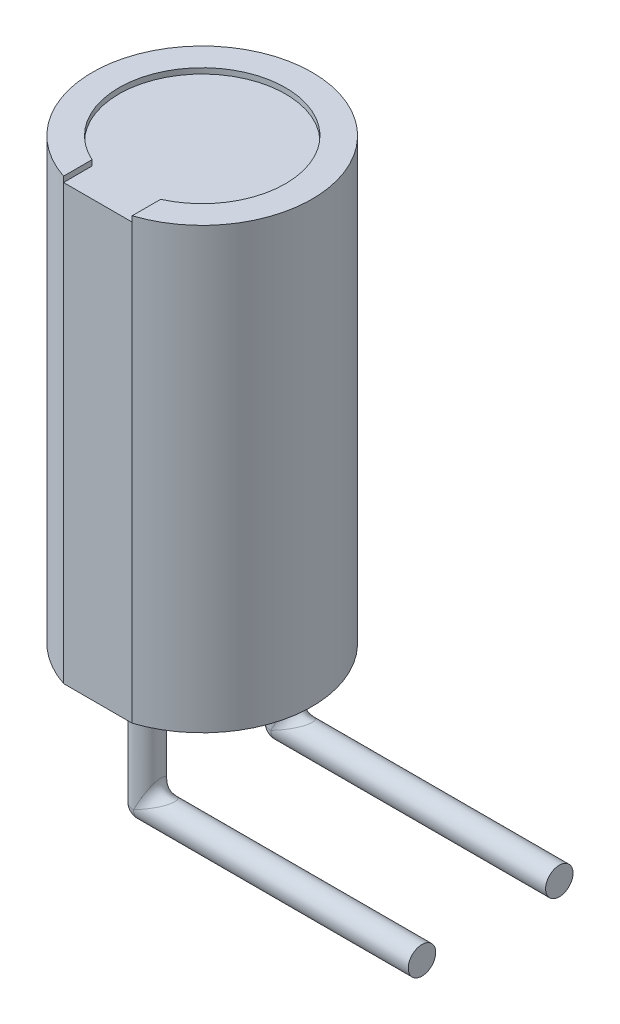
ISO-10303-21;
HEADER;
FILE_DESCRIPTION(('STEP AP214'),'2;1');
FILE_NAME('part.step','',(''),(''),'','','');
FILE_SCHEMA(('AUTOMOTIVE_DESIGN { 1 0 10303 214 1 1 1 1 }'));
ENDSEC;
DATA;
#1=APPLICATION_CONTEXT('core data for automotive mechanical design processes');
#2=APPLICATION_PROTOCOL_DEFINITION('international standard','automotive_design',2000,#1);
#3=PRODUCT_CONTEXT('',#1,'mechanical');
#4=PRODUCT('Part','Part','',(#3));
#5=PRODUCT_RELATED_PRODUCT_CATEGORY('part','',(#4));
#6=PRODUCT_DEFINITION_FORMATION('','',#4);
#7=PRODUCT_DEFINITION_CONTEXT('part definition',#1,'design');
#8=PRODUCT_DEFINITION('design','',#6,#7);
#9=PRODUCT_DEFINITION_SHAPE('','',#8);
#10=(LENGTH_UNIT() NAMED_UNIT(*) SI_UNIT(.MILLI.,.METRE.));
#11=(NAMED_UNIT(*) PLANE_ANGLE_UNIT() SI_UNIT($,.RADIAN.));
#12=(NAMED_UNIT(*) SI_UNIT($,.STERADIAN.) SOLID_ANGLE_UNIT());
#13=UNCERTAINTY_MEASURE_WITH_UNIT(LENGTH_MEASURE(1.E-05),#10,'distance_accuracy_value','');
#14=(GEOMETRIC_REPRESENTATION_CONTEXT(3) GLOBAL_UNCERTAINTY_ASSIGNED_CONTEXT((#13)) GLOBAL_UNIT_ASSIGNED_CONTEXT((#10,
#11,#12)) REPRESENTATION_CONTEXT('',''));
#15=CARTESIAN_POINT('',(0.,0.,0.));
#16=DIRECTION('',(0.,0.,1.));
#17=DIRECTION('',(1.,0.,0.));
#18=AXIS2_PLACEMENT_3D('',#15,#16,#17);
#19=CARTESIAN_POINT('',(0.,0.,0.));
#20=DIRECTION('',(0.,1.,0.));
#21=DIRECTION('',(0.,0.,1.));
#22=AXIS2_PLACEMENT_3D('',#19,#20,#21);
#23=PLANE('',#22);
#24=CARTESIAN_POINT('',(0.,0.,1.));
#25=DIRECTION('',(0.,-1.,0.));
#26=DIRECTION('',(0.,0.,-1.));
#27=AXIS2_PLACEMENT_3D('',#24,#25,#26);
#28=CIRCLE('',#27,0.25);
#29=CARTESIAN_POINT('',(0.,0.,0.75));
#30=VERTEX_POINT('',#29);
#31=EDGE_CURVE('E149',#30,#30,#28,.T.);
#32=ORIENTED_EDGE('',*,*,#31,.F.);
#33=EDGE_LOOP('',(#32));
#34=FACE_BOUND('',#33,.T.);
#35=CARTESIAN_POINT('',(0.,0.,0.));
#36=DIRECTION('',(0.,1.,0.));
#37=DIRECTION('',(0.,0.,1.));
#38=AXIS2_PLACEMENT_3D('',#35,#36,#37);
#39=CIRCLE('',#38,2.);
#40=CARTESIAN_POINT('',(0.624499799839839,0.,1.9));
#41=VERTEX_POINT('',#40);
#42=CARTESIAN_POINT('',(-0.62449979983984,0.,1.9));
#43=VERTEX_POINT('',#42);
#44=EDGE_CURVE('E142',#41,#43,#39,.T.);
#45=ORIENTED_EDGE('',*,*,#44,.F.);
#46=DIRECTION('',(-1.,0.,0.));
#47=VECTOR('',#46,1.);
#48=CARTESIAN_POINT('',(0.,0.,1.9));
#49=LINE('',#48,#47);
#50=EDGE_CURVE('E146',#41,#43,#49,.T.);
#51=ORIENTED_EDGE('',*,*,#50,.T.);
#52=EDGE_LOOP('',(#45,#51));
#53=FACE_BOUND('',#52,.T.);
#54=CARTESIAN_POINT('',(0.,0.,-1.5));
#55=DIRECTION('',(0.,-1.,0.));
#56=DIRECTION('',(0.,0.,-1.));
#57=AXIS2_PLACEMENT_3D('',#54,#55,#56);
#58=CIRCLE('',#57,0.25);
#59=CARTESIAN_POINT('',(0.,0.,-1.75));
#60=VERTEX_POINT('',#59);
#61=EDGE_CURVE('E154',#60,#60,#58,.T.);
#62=ORIENTED_EDGE('',*,*,#61,.F.);
#63=EDGE_LOOP('',(#62));
#64=FACE_BOUND('',#63,.T.);
#65=ADVANCED_FACE('F39',(#34,#53,#64),#23,.F.);
#66=CARTESIAN_POINT('',(-1.,8.,1.9));
#67=DIRECTION('',(0.,0.,-1.));
#68=DIRECTION('',(-1.,0.,0.));
#69=AXIS2_PLACEMENT_3D('',#66,#67,#68);
#70=PLANE('',#69);
#71=DIRECTION('',(1.,0.,0.));
#72=VECTOR('',#71,1.);
#73=CARTESIAN_POINT('',(-0.62449979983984,7.9,1.9));
#74=LINE('',#73,#72);
#75=CARTESIAN_POINT('',(-0.62449979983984,7.9,1.9));
#76=VERTEX_POINT('',#75);
#77=CARTESIAN_POINT('',(0.624499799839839,7.9,1.9));
#78=VERTEX_POINT('',#77);
#79=EDGE_CURVE('E129',#76,#78,#74,.T.);
#80=ORIENTED_EDGE('',*,*,#79,.F.);
#81=DIRECTION('',(0.,-1.,0.));
#82=VECTOR('',#81,1.);
#83=CARTESIAN_POINT('',(-0.62449979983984,8.,1.9));
#84=LINE('',#83,#82);
#85=EDGE_CURVE('E134',#43,#76,#84,.F.);
#86=ORIENTED_EDGE('',*,*,#85,.F.);
#87=ORIENTED_EDGE('',*,*,#50,.F.);
#88=DIRECTION('',(0.,-1.,0.));
#89=VECTOR('',#88,1.);
#90=CARTESIAN_POINT('',(0.62449979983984,8.,1.9));
#91=LINE('',#90,#89);
#92=EDGE_CURVE('E138',#78,#41,#91,.T.);
#93=ORIENTED_EDGE('',*,*,#92,.F.);
#94=EDGE_LOOP('',(#80,#86,#87,#93));
#95=FACE_BOUND('',#94,.T.);
#96=ADVANCED_FACE('F187',(#95),#70,.F.);
#97=CARTESIAN_POINT('',(0.,8.,0.));
#98=DIRECTION('',(0.,-1.,0.));
#99=DIRECTION('',(0.,0.,-1.));
#100=AXIS2_PLACEMENT_3D('',#97,#98,#99);
#101=CYLINDRICAL_SURFACE('',#100,2.);
#102=CARTESIAN_POINT('',(0.,8.,0.));
#103=DIRECTION('',(0.,1.,0.));
#104=DIRECTION('',(0.,0.,1.));
#105=AXIS2_PLACEMENT_3D('',#102,#103,#104);
#106=CIRCLE('',#105,2.);
#107=CARTESIAN_POINT('',(0.624499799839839,8.,1.9));
#108=VERTEX_POINT('',#107);
#109=CARTESIAN_POINT('',(-0.62449979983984,8.,1.9));
#110=VERTEX_POINT('',#109);
#111=EDGE_CURVE('E120',#108,#110,#106,.T.);
#112=ORIENTED_EDGE('',*,*,#111,.F.);
#113=EDGE_CURVE('E139',#108,#78,#91,.T.);
#114=ORIENTED_EDGE('',*,*,#113,.T.);
#115=ORIENTED_EDGE('',*,*,#92,.T.);
#116=ORIENTED_EDGE('',*,*,#44,.T.);
#117=ORIENTED_EDGE('',*,*,#85,.T.);
#118=DIRECTION('',(0.,1.,0.));
#119=VECTOR('',#118,1.);
#120=CARTESIAN_POINT('',(-0.62449979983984,7.9,1.9));
#121=LINE('',#120,#119);
#122=EDGE_CURVE('E105',#76,#110,#121,.T.);
#123=ORIENTED_EDGE('',*,*,#122,.T.);
#124=EDGE_LOOP('',(#112,#114,#115,#116,#117,#123));
#125=FACE_BOUND('',#124,.T.);
#126=ADVANCED_FACE('F41',(#125),#101,.T.);
#127=CARTESIAN_POINT('',(0.,8.,0.));
#128=DIRECTION('',(0.,1.,0.));
#129=DIRECTION('',(0.,0.,1.));
#130=AXIS2_PLACEMENT_3D('',#127,#128,#129);
#131=PLANE('',#130);
#132=DIRECTION('',(0.,0.,-1.));
#133=VECTOR('',#132,1.);
#134=CARTESIAN_POINT('',(0.624499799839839,8.,1.38143930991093));
#135=LINE('',#134,#133);
#136=CARTESIAN_POINT('',(0.624499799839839,8.,1.38143930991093));
#137=VERTEX_POINT('',#136);
#138=EDGE_CURVE('E121',#108,#137,#135,.T.);
#139=ORIENTED_EDGE('',*,*,#138,.F.);
#140=ORIENTED_EDGE('',*,*,#111,.T.);
#141=DIRECTION('',(0.,0.,1.));
#142=VECTOR('',#141,1.);
#143=CARTESIAN_POINT('',(-0.624499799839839,8.,1.38143930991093));
#144=LINE('',#143,#142);
#145=CARTESIAN_POINT('',(-0.624499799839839,8.,1.38143930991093));
#146=VERTEX_POINT('',#145);
#147=EDGE_CURVE('E99',#146,#110,#144,.T.);
#148=ORIENTED_EDGE('',*,*,#147,.F.);
#149=CARTESIAN_POINT('',(0.,8.,0.));
#150=DIRECTION('',(0.,1.,0.));
#151=DIRECTION('',(0.,0.,1.));
#152=AXIS2_PLACEMENT_3D('',#149,#150,#151);
#153=CIRCLE('',#152,1.51603910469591);
#154=EDGE_CURVE('E109',#137,#146,#153,.T.);
#155=ORIENTED_EDGE('',*,*,#154,.F.);
#156=EDGE_LOOP('',(#139,#140,#148,#155));
#157=FACE_BOUND('',#156,.T.);
#158=ADVANCED_FACE('F118',(#157),#131,.T.);
#159=CARTESIAN_POINT('',(0.,7.9,0.));
#160=DIRECTION('',(0.,1.,0.));
#161=DIRECTION('',(0.,0.,1.));
#162=AXIS2_PLACEMENT_3D('',#159,#160,#161);
#163=CYLINDRICAL_SURFACE('',#162,1.51603910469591);
#164=ORIENTED_EDGE('',*,*,#154,.T.);
#165=DIRECTION('',(0.,1.,0.));
#166=VECTOR('',#165,1.);
#167=CARTESIAN_POINT('',(-0.624499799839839,7.9,1.38143930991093));
#168=LINE('',#167,#166);
#169=CARTESIAN_POINT('',(-0.624499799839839,7.9,1.38143930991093));
#170=VERTEX_POINT('',#169);
#171=EDGE_CURVE('E94',#170,#146,#168,.T.);
#172=ORIENTED_EDGE('',*,*,#171,.F.);
#173=CARTESIAN_POINT('',(0.,7.9,0.));
#174=DIRECTION('',(0.,1.,0.));
#175=DIRECTION('',(0.,0.,1.));
#176=AXIS2_PLACEMENT_3D('',#173,#174,#175);
#177=CIRCLE('',#176,1.51603910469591);
#178=CARTESIAN_POINT('',(0.624499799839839,7.9,1.38143930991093));
#179=VERTEX_POINT('',#178);
#180=EDGE_CURVE('E123',#179,#170,#177,.T.);
#181=ORIENTED_EDGE('',*,*,#180,.F.);
#182=DIRECTION('',(0.,1.,0.));
#183=VECTOR('',#182,1.);
#184=CARTESIAN_POINT('',(0.624499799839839,7.9,1.38143930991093));
#185=LINE('',#184,#183);
#186=EDGE_CURVE('E111',#179,#137,#185,.T.);
#187=ORIENTED_EDGE('',*,*,#186,.T.);
#188=EDGE_LOOP('',(#164,#172,#181,#187));
#189=FACE_BOUND('',#188,.T.);
#190=ADVANCED_FACE('F110',(#189),#163,.F.);
#191=CARTESIAN_POINT('',(0.624499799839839,7.9,1.38143930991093));
#192=DIRECTION('',(1.,0.,0.));
#193=DIRECTION('',(0.,0.,-1.));
#194=AXIS2_PLACEMENT_3D('',#191,#192,#193);
#195=PLANE('',#194);
#196=ORIENTED_EDGE('',*,*,#138,.T.);
#197=ORIENTED_EDGE('',*,*,#186,.F.);
#198=DIRECTION('',(0.,0.,-1.));
#199=VECTOR('',#198,1.);
#200=CARTESIAN_POINT('',(0.624499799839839,7.9,1.38143930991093));
#201=LINE('',#200,#199);
#202=EDGE_CURVE('E106',#78,#179,#201,.T.);
#203=ORIENTED_EDGE('',*,*,#202,.F.);
#204=ORIENTED_EDGE('',*,*,#113,.F.);
#205=EDGE_LOOP('',(#196,#197,#203,#204));
#206=FACE_BOUND('',#205,.T.);
#207=ADVANCED_FACE('F203',(#206),#195,.F.);
#208=CARTESIAN_POINT('',(-0.624499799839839,7.9,1.38143930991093));
#209=DIRECTION('',(-1.,0.,0.));
#210=DIRECTION('',(0.,0.,1.));
#211=AXIS2_PLACEMENT_3D('',#208,#209,#210);
#212=PLANE('',#211);
#213=ORIENTED_EDGE('',*,*,#147,.T.);
#214=ORIENTED_EDGE('',*,*,#122,.F.);
#215=DIRECTION('',(0.,0.,1.));
#216=VECTOR('',#215,1.);
#217=CARTESIAN_POINT('',(-0.624499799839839,7.9,1.38143930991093));
#218=LINE('',#217,#216);
#219=EDGE_CURVE('E101',#170,#76,#218,.T.);
#220=ORIENTED_EDGE('',*,*,#219,.F.);
#221=ORIENTED_EDGE('',*,*,#171,.T.);
#222=EDGE_LOOP('',(#213,#214,#220,#221));
#223=FACE_BOUND('',#222,.T.);
#224=ADVANCED_FACE('F96',(#223),#212,.F.);
#225=CARTESIAN_POINT('',(0.,7.9,0.));
#226=DIRECTION('',(0.,1.,0.));
#227=DIRECTION('',(0.,0.,1.));
#228=AXIS2_PLACEMENT_3D('',#225,#226,#227);
#229=PLANE('',#228);
#230=ORIENTED_EDGE('',*,*,#180,.T.);
#231=ORIENTED_EDGE('',*,*,#219,.T.);
#232=ORIENTED_EDGE('',*,*,#79,.T.);
#233=ORIENTED_EDGE('',*,*,#202,.T.);
#234=EDGE_LOOP('',(#230,#231,#232,#233));
#235=FACE_BOUND('',#234,.T.);
#236=ADVANCED_FACE('F212',(#235),#229,.T.);
#237=CARTESIAN_POINT('',(0.,-2.,1.));
#238=DIRECTION('',(1.,0.,0.));
#239=DIRECTION('',(0.,0.,-1.));
#240=AXIS2_PLACEMENT_3D('',#237,#238,#239);
#241=CYLINDRICAL_SURFACE('',#240,0.25);
#242=CARTESIAN_POINT('',(0.,-2.,1.));
#243=DIRECTION('',(-0.447213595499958,0.894427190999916,0.));
#244=DIRECTION('',(0.894427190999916,0.447213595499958,0.));
#245=AXIS2_PLACEMENT_3D('',#242,#243,#244);
#246=ELLIPSE('',#245,0.559016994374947,0.25);
#247=CARTESIAN_POINT('',(0.,-2.,0.75));
#248=VERTEX_POINT('',#247);
#249=CARTESIAN_POINT('',(0.,-2.,1.25));
#250=VERTEX_POINT('',#249);
#251=EDGE_CURVE('E150',#248,#250,#246,.F.);
#252=ORIENTED_EDGE('',*,*,#251,.T.);
#253=CARTESIAN_POINT('',(0.,-2.,1.));
#254=DIRECTION('',(1.,0.,0.));
#255=DIRECTION('',(0.,0.,-1.));
#256=AXIS2_PLACEMENT_3D('',#253,#254,#255);
#257=CIRCLE('',#256,0.25);
#258=EDGE_CURVE('E153',#250,#248,#257,.T.);
#259=ORIENTED_EDGE('',*,*,#258,.T.);
#260=EDGE_LOOP('',(#252,#259));
#261=FACE_BOUND('',#260,.T.);
#262=CARTESIAN_POINT('',(5.,-2.,1.));
#263=DIRECTION('',(1.,0.,0.));
#264=DIRECTION('',(0.,0.,-1.));
#265=AXIS2_PLACEMENT_3D('',#262,#263,#264);
#266=CIRCLE('',#265,0.25);
#267=CARTESIAN_POINT('',(5.,-2.,0.75));
#268=VERTEX_POINT('',#267);
#269=EDGE_CURVE('E115',#268,#268,#266,.F.);
#270=ORIENTED_EDGE('',*,*,#269,.T.);
#271=EDGE_LOOP('',(#270));
#272=FACE_BOUND('',#271,.T.);
#273=ADVANCED_FACE('F223',(#261,#272),#241,.T.);
#274=CARTESIAN_POINT('',(0.,-2.70710678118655,1.));
#275=DIRECTION('',(0.,1.,0.));
#276=DIRECTION('',(-1.,0.,0.));
#277=AXIS2_PLACEMENT_3D('',#274,#275,#276);
#278=CYLINDRICAL_SURFACE('',#277,0.25);
#279=ORIENTED_EDGE('',*,*,#31,.T.);
#280=EDGE_LOOP('',(#279));
#281=FACE_BOUND('',#280,.T.);
#282=CARTESIAN_POINT('',(0.,-2.,1.));
#283=DIRECTION('',(0.,1.,0.));
#284=DIRECTION('',(-1.,0.,0.));
#285=AXIS2_PLACEMENT_3D('',#282,#283,#284);
#286=CIRCLE('',#285,0.25);
#287=EDGE_CURVE('E157',#248,#250,#286,.T.);
#288=ORIENTED_EDGE('',*,*,#287,.T.);
#289=CARTESIAN_POINT('',(0.,-2.,1.));
#290=DIRECTION('',(-0.894427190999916,0.447213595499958,0.));
#291=DIRECTION('',(0.447213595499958,0.894427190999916,0.));
#292=AXIS2_PLACEMENT_3D('',#289,#290,#291);
#293=ELLIPSE('',#292,0.559016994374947,0.25);
#294=EDGE_CURVE('E160',#250,#248,#293,.T.);
#295=ORIENTED_EDGE('',*,*,#294,.T.);
#296=EDGE_LOOP('',(#288,#295));
#297=FACE_BOUND('',#296,.T.);
#298=ADVANCED_FACE('F227',(#281,#297),#278,.T.);
#299=CARTESIAN_POINT('',(5.,-2.,1.));
#300=DIRECTION('',(1.,0.,0.));
#301=DIRECTION('',(0.,0.,-1.));
#302=AXIS2_PLACEMENT_3D('',#299,#300,#301);
#303=PLANE('',#302);
#304=ORIENTED_EDGE('',*,*,#269,.F.);
#305=EDGE_LOOP('',(#304));
#306=FACE_BOUND('',#305,.T.);
#307=ADVANCED_FACE('F250',(#306),#303,.T.);
#308=CARTESIAN_POINT('',(0.,-2.,-1.5));
#309=DIRECTION('',(1.,0.,0.));
#310=DIRECTION('',(0.,0.,-1.));
#311=AXIS2_PLACEMENT_3D('',#308,#309,#310);
#312=CYLINDRICAL_SURFACE('',#311,0.25);
#313=CARTESIAN_POINT('',(0.,-2.,-1.5));
#314=DIRECTION('',(-0.447213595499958,0.894427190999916,0.));
#315=DIRECTION('',(0.894427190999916,0.447213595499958,0.));
#316=AXIS2_PLACEMENT_3D('',#313,#314,#315);
#317=ELLIPSE('',#316,0.559016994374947,0.25);
#318=CARTESIAN_POINT('',(0.,-2.,-1.75));
#319=VERTEX_POINT('',#318);
#320=CARTESIAN_POINT('',(0.,-2.,-1.25));
#321=VERTEX_POINT('',#320);
#322=EDGE_CURVE('E163',#319,#321,#317,.F.);
#323=ORIENTED_EDGE('',*,*,#322,.T.);
#324=CARTESIAN_POINT('',(0.,-2.,-1.5));
#325=DIRECTION('',(1.,0.,0.));
#326=DIRECTION('',(0.,0.,-1.));
#327=AXIS2_PLACEMENT_3D('',#324,#325,#326);
#328=CIRCLE('',#327,0.25);
#329=EDGE_CURVE('E166',#321,#319,#328,.T.);
#330=ORIENTED_EDGE('',*,*,#329,.T.);
#331=EDGE_LOOP('',(#323,#330));
#332=FACE_BOUND('',#331,.T.);
#333=CARTESIAN_POINT('',(5.,-2.,-1.5));
#334=DIRECTION('',(1.,0.,0.));
#335=DIRECTION('',(0.,0.,-1.));
#336=AXIS2_PLACEMENT_3D('',#333,#334,#335);
#337=CIRCLE('',#336,0.25);
#338=CARTESIAN_POINT('',(5.,-2.,-1.75));
#339=VERTEX_POINT('',#338);
#340=EDGE_CURVE('E242',#339,#339,#337,.F.);
#341=ORIENTED_EDGE('',*,*,#340,.T.);
#342=EDGE_LOOP('',(#341));
#343=FACE_BOUND('',#342,.T.);
#344=ADVANCED_FACE('F171',(#332,#343),#312,.T.);
#345=CARTESIAN_POINT('',(0.,-2.70710678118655,-1.5));
#346=DIRECTION('',(0.,1.,0.));
#347=DIRECTION('',(-1.,0.,0.));
#348=AXIS2_PLACEMENT_3D('',#345,#346,#347);
#349=CYLINDRICAL_SURFACE('',#348,0.25);
#350=ORIENTED_EDGE('',*,*,#61,.T.);
#351=EDGE_LOOP('',(#350));
#352=FACE_BOUND('',#351,.T.);
#353=CARTESIAN_POINT('',(0.,-2.,-1.5));
#354=DIRECTION('',(0.,1.,0.));
#355=DIRECTION('',(-1.,0.,0.));
#356=AXIS2_PLACEMENT_3D('',#353,#354,#355);
#357=CIRCLE('',#356,0.25);
#358=EDGE_CURVE('E47',#319,#321,#357,.T.);
#359=ORIENTED_EDGE('',*,*,#358,.T.);
#360=CARTESIAN_POINT('',(0.,-2.,-1.5));
#361=DIRECTION('',(-0.894427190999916,0.447213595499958,0.));
#362=DIRECTION('',(0.447213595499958,0.894427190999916,0.));
#363=AXIS2_PLACEMENT_3D('',#360,#361,#362);
#364=ELLIPSE('',#363,0.559016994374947,0.25);
#365=EDGE_CURVE('E12',#321,#319,#364,.T.);
#366=ORIENTED_EDGE('',*,*,#365,.T.);
#367=EDGE_LOOP('',(#359,#366));
#368=FACE_BOUND('',#367,.T.);
#369=ADVANCED_FACE('F169',(#352,#368),#349,.T.);
#370=CARTESIAN_POINT('',(5.,-2.,-1.5));
#371=DIRECTION('',(1.,0.,0.));
#372=DIRECTION('',(0.,0.,-1.));
#373=AXIS2_PLACEMENT_3D('',#370,#371,#372);
#374=PLANE('',#373);
#375=ORIENTED_EDGE('',*,*,#340,.F.);
#376=EDGE_LOOP('',(#375));
#377=FACE_BOUND('',#376,.T.);
#378=ADVANCED_FACE('F264',(#377),#374,.T.);
#379=CARTESIAN_POINT('',(0.,-2.,1.));
#380=DIRECTION('',(0.,0.,1.));
#381=DIRECTION('',(1.,0.,0.));
#382=AXIS2_PLACEMENT_3D('',#379,#380,#381);
#383=SPHERICAL_SURFACE('',#382,0.25);
#384=ORIENTED_EDGE('',*,*,#258,.F.);
#385=ORIENTED_EDGE('',*,*,#287,.F.);
#386=EDGE_LOOP('',(#384,#385));
#387=FACE_BOUND('',#386,.T.);
#388=ADVANCED_FACE('F183',(#387),#383,.T.);
#389=CARTESIAN_POINT('',(0.,-2.,0.75));
#390=CARTESIAN_POINT('',(0.,-2.,0.75));
#391=CARTESIAN_POINT('',(0.,-2.,0.75));
#392=CARTESIAN_POINT('',(0.021782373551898,-1.98910881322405,0.750004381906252));
#393=CARTESIAN_POINT('',(0.0163401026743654,-1.98365989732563,0.749968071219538));
#394=CARTESIAN_POINT('',(0.0108911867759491,-1.9782176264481,0.750004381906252));
#395=CARTESIAN_POINT('',(0.0435703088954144,-1.97821484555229,0.750712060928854));
#396=CARTESIAN_POINT('',(0.0327250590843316,-1.96727494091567,0.751424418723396));
#397=CARTESIAN_POINT('',(0.0217851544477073,-1.95642969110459,0.750712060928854));
#398=CARTESIAN_POINT('',(0.0867714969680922,-1.95661425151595,0.753553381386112));
#399=CARTESIAN_POINT('',(0.06484351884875,-1.93515648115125,0.757104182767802));
#400=CARTESIAN_POINT('',(0.0433857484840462,-1.91322850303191,0.753553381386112));
#401=CARTESIAN_POINT('',(0.108186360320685,-1.94590681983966,0.755674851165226));
#402=CARTESIAN_POINT('',(0.0806697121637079,-1.91933028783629,0.761335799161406));
#403=CARTESIAN_POINT('',(0.0540931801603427,-1.89181363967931,0.755674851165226));
#404=CARTESIAN_POINT('',(0.150276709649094,-1.92486164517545,0.761314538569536));
#405=CARTESIAN_POINT('',(0.111116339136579,-1.88888366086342,0.772406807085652));
#406=CARTESIAN_POINT('',(0.0751383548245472,-1.84972329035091,0.761314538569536));
#407=CARTESIAN_POINT('',(0.170958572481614,-1.91452071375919,0.764808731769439));
#408=CARTESIAN_POINT('',(0.125828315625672,-1.87417168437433,0.77926236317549));
#409=CARTESIAN_POINT('',(0.085479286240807,-1.82904142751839,0.764808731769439));
#410=CARTESIAN_POINT('',(0.211222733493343,-1.89438863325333,0.773147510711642));
#411=CARTESIAN_POINT('',(0.153510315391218,-1.84648968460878,0.795228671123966));
#412=CARTESIAN_POINT('',(0.105611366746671,-1.78877726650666,0.773147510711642));
#413=CARTESIAN_POINT('',(0.230819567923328,-1.88459021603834,0.777956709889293));
#414=CARTESIAN_POINT('',(0.166568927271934,-1.83343107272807,0.804363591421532));
#415=CARTESIAN_POINT('',(0.115409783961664,-1.76918043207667,0.777956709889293));
#416=CARTESIAN_POINT('',(0.268569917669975,-1.86571504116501,0.788854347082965));
#417=CARTESIAN_POINT('',(0.190445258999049,-1.80955474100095,0.824374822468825));
#418=CARTESIAN_POINT('',(0.134284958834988,-1.73143008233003,0.788854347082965));
#419=CARTESIAN_POINT('',(0.286749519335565,-1.85662524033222,0.794897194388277));
#420=CARTESIAN_POINT('',(0.201346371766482,-1.79865362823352,0.835282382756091));
#421=CARTESIAN_POINT('',(0.143374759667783,-1.71325048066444,0.794897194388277));
#422=CARTESIAN_POINT('',(0.321342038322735,-1.83932898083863,0.808169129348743));
#423=CARTESIAN_POINT('',(0.220487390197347,-1.77951260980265,0.858113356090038));
#424=CARTESIAN_POINT('',(0.160671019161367,-1.67865796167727,0.808169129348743));
#425=CARTESIAN_POINT('',(0.337795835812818,-1.83110208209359,0.815344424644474));
#426=CARTESIAN_POINT('',(0.228802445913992,-1.77119755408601,0.87007302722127));
#427=CARTESIAN_POINT('',(0.168897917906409,-1.66220416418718,0.815344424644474));
#428=CARTESIAN_POINT('',(0.368639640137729,-1.81568017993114,0.830766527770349));
#429=CARTESIAN_POINT('',(0.242503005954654,-1.75749699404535,0.894051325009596));
#430=CARTESIAN_POINT('',(0.184319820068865,-1.63136035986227,0.830766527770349));
#431=CARTESIAN_POINT('',(0.383087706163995,-1.808456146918,0.838954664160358));
#432=CARTESIAN_POINT('',(0.247952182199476,-1.75204781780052,0.906107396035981));
#433=CARTESIAN_POINT('',(0.191543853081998,-1.616912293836,0.838954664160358));
#434=CARTESIAN_POINT('',(0.409654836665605,-1.7951725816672,0.856266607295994));
#435=CARTESIAN_POINT('',(0.255920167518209,-1.74407983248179,0.929115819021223));
#436=CARTESIAN_POINT('',(0.204827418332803,-1.59034516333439,0.856266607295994));
#437=CARTESIAN_POINT('',(0.421849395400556,-1.78907530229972,0.865331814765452));
#438=CARTESIAN_POINT('',(0.258488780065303,-1.7415112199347,0.940101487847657));
#439=CARTESIAN_POINT('',(0.210924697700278,-1.57815060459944,0.865331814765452));
#440=CARTESIAN_POINT('',(0.443682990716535,-1.77815850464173,0.88424119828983));
#441=CARTESIAN_POINT('',(0.261106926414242,-1.73889307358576,0.959751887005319));
#442=CARTESIAN_POINT('',(0.221841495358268,-1.55631700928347,0.88424119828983));
#443=CARTESIAN_POINT('',(0.453411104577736,-1.77329444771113,0.894033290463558));
#444=CARTESIAN_POINT('',(0.261192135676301,-1.7388078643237,0.968440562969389));
#445=CARTESIAN_POINT('',(0.226705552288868,-1.54658889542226,0.894033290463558));
#446=CARTESIAN_POINT('',(0.470132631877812,-1.76493368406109,0.914219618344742));
#447=CARTESIAN_POINT('',(0.259765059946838,-1.74023494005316,0.982582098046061));
#448=CARTESIAN_POINT('',(0.235066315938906,-1.52986736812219,0.914219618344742));
#449=CARTESIAN_POINT('',(0.477218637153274,-1.76139068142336,0.924574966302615));
#450=CARTESIAN_POINT('',(0.258276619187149,-1.74172338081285,0.988047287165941));
#451=CARTESIAN_POINT('',(0.238609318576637,-1.52278136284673,0.924574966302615));
#452=CARTESIAN_POINT('',(0.488534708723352,-1.75573264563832,0.945693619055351));
#453=CARTESIAN_POINT('',(0.255023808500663,-1.74497619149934,0.99566549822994));
#454=CARTESIAN_POINT('',(0.244267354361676,-1.51146529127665,0.945693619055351));
#455=CARTESIAN_POINT('',(0.492844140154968,-1.75357792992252,0.956435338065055));
#456=CARTESIAN_POINT('',(0.253274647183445,-1.74672535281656,0.997822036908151));
#457=CARTESIAN_POINT('',(0.246422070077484,-1.50715585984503,0.956435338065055));
#458=CARTESIAN_POINT('',(0.498553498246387,-1.75072325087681,0.978122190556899));
#459=CARTESIAN_POINT('',(0.250758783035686,-1.74924121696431,0.999985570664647));
#460=CARTESIAN_POINT('',(0.249276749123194,-1.50144650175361,0.978122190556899));
#461=CARTESIAN_POINT('',(0.5,-1.75,0.98906109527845));
#462=CARTESIAN_POINT('',(0.25,-1.75,0.999992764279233));
#463=CARTESIAN_POINT('',(0.25,-1.5,0.98906109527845));
#464=CARTESIAN_POINT('',(0.5,-1.75,1.01093890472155));
#465=CARTESIAN_POINT('',(0.25,-1.75,1.00000723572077));
#466=CARTESIAN_POINT('',(0.25,-1.5,1.01093890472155));
#467=CARTESIAN_POINT('',(0.498553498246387,-1.75072325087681,1.0218778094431));
#468=CARTESIAN_POINT('',(0.250758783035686,-1.74924121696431,1.00001442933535));
#469=CARTESIAN_POINT('',(0.249276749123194,-1.50144650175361,1.0218778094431));
#470=CARTESIAN_POINT('',(0.492844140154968,-1.75357792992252,1.04356466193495));
#471=CARTESIAN_POINT('',(0.253274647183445,-1.74672535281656,1.00217796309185));
#472=CARTESIAN_POINT('',(0.246422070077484,-1.50715585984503,1.04356466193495));
#473=CARTESIAN_POINT('',(0.488534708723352,-1.75573264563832,1.05430638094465));
#474=CARTESIAN_POINT('',(0.255023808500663,-1.74497619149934,1.00433450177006));
#475=CARTESIAN_POINT('',(0.244267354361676,-1.51146529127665,1.05430638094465));
#476=CARTESIAN_POINT('',(0.477218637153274,-1.76139068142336,1.07542503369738));
#477=CARTESIAN_POINT('',(0.258276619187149,-1.74172338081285,1.01195271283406));
#478=CARTESIAN_POINT('',(0.238609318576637,-1.52278136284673,1.07542503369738));
#479=CARTESIAN_POINT('',(0.470132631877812,-1.76493368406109,1.08578038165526));
#480=CARTESIAN_POINT('',(0.259765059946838,-1.74023494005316,1.01741790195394));
#481=CARTESIAN_POINT('',(0.235066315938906,-1.52986736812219,1.08578038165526));
#482=CARTESIAN_POINT('',(0.453411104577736,-1.77329444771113,1.10596670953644));
#483=CARTESIAN_POINT('',(0.261192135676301,-1.7388078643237,1.03155943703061));
#484=CARTESIAN_POINT('',(0.226705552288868,-1.54658889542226,1.10596670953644));
#485=CARTESIAN_POINT('',(0.443682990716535,-1.77815850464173,1.11575880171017));
#486=CARTESIAN_POINT('',(0.261106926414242,-1.73889307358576,1.04024811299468));
#487=CARTESIAN_POINT('',(0.221841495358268,-1.55631700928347,1.11575880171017));
#488=CARTESIAN_POINT('',(0.421849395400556,-1.78907530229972,1.13466818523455));
#489=CARTESIAN_POINT('',(0.258488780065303,-1.7415112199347,1.05989851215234));
#490=CARTESIAN_POINT('',(0.210924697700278,-1.57815060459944,1.13466818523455));
#491=CARTESIAN_POINT('',(0.409654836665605,-1.7951725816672,1.14373339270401));
#492=CARTESIAN_POINT('',(0.255920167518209,-1.74407983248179,1.07088418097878));
#493=CARTESIAN_POINT('',(0.204827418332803,-1.59034516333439,1.14373339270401));
#494=CARTESIAN_POINT('',(0.383087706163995,-1.808456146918,1.16104533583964));
#495=CARTESIAN_POINT('',(0.247952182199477,-1.75204781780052,1.09389260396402));
#496=CARTESIAN_POINT('',(0.191543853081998,-1.616912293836,1.16104533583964));
#497=CARTESIAN_POINT('',(0.368639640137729,-1.81568017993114,1.16923347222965));
#498=CARTESIAN_POINT('',(0.242503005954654,-1.75749699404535,1.1059486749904));
#499=CARTESIAN_POINT('',(0.184319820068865,-1.63136035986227,1.16923347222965));
#500=CARTESIAN_POINT('',(0.337795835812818,-1.83110208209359,1.18465557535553));
#501=CARTESIAN_POINT('',(0.228802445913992,-1.77119755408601,1.12992697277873));
#502=CARTESIAN_POINT('',(0.168897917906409,-1.66220416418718,1.18465557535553));
#503=CARTESIAN_POINT('',(0.321342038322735,-1.83932898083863,1.19183087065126));
#504=CARTESIAN_POINT('',(0.220487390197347,-1.77951260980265,1.14188664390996));
#505=CARTESIAN_POINT('',(0.160671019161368,-1.67865796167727,1.19183087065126));
#506=CARTESIAN_POINT('',(0.286749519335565,-1.85662524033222,1.20510280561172));
#507=CARTESIAN_POINT('',(0.201346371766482,-1.79865362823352,1.16471761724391));
#508=CARTESIAN_POINT('',(0.143374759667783,-1.71325048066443,1.20510280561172));
#509=CARTESIAN_POINT('',(0.268569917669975,-1.86571504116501,1.21114565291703));
#510=CARTESIAN_POINT('',(0.190445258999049,-1.80955474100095,1.17562517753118));
#511=CARTESIAN_POINT('',(0.134284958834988,-1.73143008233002,1.21114565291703));
#512=CARTESIAN_POINT('',(0.230819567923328,-1.88459021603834,1.22204329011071));
#513=CARTESIAN_POINT('',(0.166568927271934,-1.83343107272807,1.19563640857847));
#514=CARTESIAN_POINT('',(0.115409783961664,-1.76918043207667,1.22204329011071));
#515=CARTESIAN_POINT('',(0.211222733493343,-1.89438863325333,1.22685248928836));
#516=CARTESIAN_POINT('',(0.153510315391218,-1.84648968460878,1.20477132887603));
#517=CARTESIAN_POINT('',(0.105611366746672,-1.78877726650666,1.22685248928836));
#518=CARTESIAN_POINT('',(0.170958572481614,-1.91452071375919,1.23519126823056));
#519=CARTESIAN_POINT('',(0.125828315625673,-1.87417168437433,1.22073763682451));
#520=CARTESIAN_POINT('',(0.0854792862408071,-1.82904142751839,1.23519126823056));
#521=CARTESIAN_POINT('',(0.150276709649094,-1.92486164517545,1.23868546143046));
#522=CARTESIAN_POINT('',(0.111116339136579,-1.88888366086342,1.22759319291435));
#523=CARTESIAN_POINT('',(0.0751383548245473,-1.84972329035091,1.23868546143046));
#524=CARTESIAN_POINT('',(0.108186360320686,-1.94590681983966,1.24432514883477));
#525=CARTESIAN_POINT('',(0.0806697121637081,-1.91933028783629,1.23866420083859));
#526=CARTESIAN_POINT('',(0.0540931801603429,-1.89181363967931,1.24432514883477));
#527=CARTESIAN_POINT('',(0.0867714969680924,-1.95661425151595,1.24644661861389));
#528=CARTESIAN_POINT('',(0.0648435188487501,-1.93515648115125,1.2428958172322));
#529=CARTESIAN_POINT('',(0.0433857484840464,-1.91322850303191,1.24644661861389));
#530=CARTESIAN_POINT('',(0.0435703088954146,-1.97821484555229,1.24928793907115));
#531=CARTESIAN_POINT('',(0.0327250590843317,-1.96727494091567,1.2485755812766));
#532=CARTESIAN_POINT('',(0.0217851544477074,-1.95642969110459,1.24928793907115));
#533=CARTESIAN_POINT('',(0.0217823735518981,-1.98910881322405,1.24999561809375));
#534=CARTESIAN_POINT('',(0.0163401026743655,-1.98365989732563,1.25003192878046));
#535=CARTESIAN_POINT('',(0.0108911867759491,-1.9782176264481,1.24999561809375));
#536=CARTESIAN_POINT('',(0.,-2.,1.25));
#537=CARTESIAN_POINT('',(0.,-2.,1.25));
#538=CARTESIAN_POINT('',(0.,-2.,1.25));
#539=(BOUNDED_SURFACE() B_SPLINE_SURFACE(3,2,((#389,#390,#391),(#392,#393,#394),(#395,#396,
#397),(#398,#399,#400),(#401,#402,#403),(#404,#405,#406),(#407,#408,#409),(#410,#411,#412),
(#413,#414,#415),(#416,#417,#418),(#419,#420,#421),(#422,#423,#424),(#425,#426,#427),(#428,#429,
#430),(#431,#432,#433),(#434,#435,#436),(#437,#438,#439),(#440,#441,#442),(#443,#444,#445),
(#446,#447,#448),(#449,#450,#451),(#452,#453,#454),(#455,#456,#457),(#458,#459,#460),(#461,#462,
#463),(#464,#465,#466),(#467,#468,#469),(#470,#471,#472),(#473,#474,#475),(#476,#477,#478),
(#479,#480,#481),(#482,#483,#484),(#485,#486,#487),(#488,#489,#490),(#491,#492,#493),(#494,#495,
#496),(#497,#498,#499),(#500,#501,#502),(#503,#504,#505),(#506,#507,#508),(#509,#510,#511),
(#512,#513,#514),(#515,#516,#517),(#518,#519,#520),(#521,#522,#523),(#524,#525,#526),(#527,#528,
#529),(#530,#531,#532),(#533,#534,#535),(#536,#537,#538)),.UNSPECIFIED.,.F.,.F.,
.F.) B_SPLINE_SURFACE_WITH_KNOTS((4,2,2,2,2,2,2,2,2,2,2,2,2,2,2,2,2,2,2,2,2,2,2,2,4),(3,3),(0.,
0.0923950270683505,0.184004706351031,0.274077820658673,0.361932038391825,0.446989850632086,
0.528816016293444,0.607156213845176,0.681975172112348,0.753489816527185,0.822188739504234,
0.888824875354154,0.954367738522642,1.01991060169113,1.08654673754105,1.1552456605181,
1.22676030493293,1.30157926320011,1.37991946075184,1.4617456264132,1.54680343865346,
1.63465765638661,1.72473077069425,1.81634044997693,1.90873547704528),(0.,1.),
.UNSPECIFIED.) GEOMETRIC_REPRESENTATION_ITEM() RATIONAL_B_SPLINE_SURFACE(((1.,1.,1.),(1.,
1.00000566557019,1.),(1.,0.998576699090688,1.),(1.,0.992910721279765,1.),(1.,0.988697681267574,
1.),(1.,0.97761712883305,1.),(1.,0.970795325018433,1.),(1.,0.954789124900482,1.),(1.,
0.945667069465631,1.),(1.,0.92548796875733,1.),(1.,0.914501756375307,1.),(1.,0.891169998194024,
1.),(1.,0.878891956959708,1.),(1.,0.853706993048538,1.),(1.,0.84084914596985,1.),(1.,
0.815387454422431,1.),(1.,0.802798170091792,1.),(1.,0.778880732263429,1.),(1.,0.767521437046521,
1.),(1.,0.747118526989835,1.),(1.,0.738001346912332,1.),(1.,0.723039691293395,1.),(1.,
0.717105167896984,1.),(1.,0.709170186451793,1.),(1.,0.707106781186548,1.),(1.,0.707106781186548,
1.),(1.,0.709170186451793,1.),(1.,0.717105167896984,1.),(1.,0.723039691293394,1.),(1.,
0.738001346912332,1.),(1.,0.747118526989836,1.),(1.,0.767521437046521,1.),(1.,0.778880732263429,
1.),(1.,0.802798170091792,1.),(1.,0.815387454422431,1.),(1.,0.84084914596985,1.),(1.,
0.853706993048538,1.),(1.,0.878891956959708,1.),(1.,0.891169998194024,1.),(1.,0.914501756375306,
1.),(1.,0.92548796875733,1.),(1.,0.945667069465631,1.),(1.,0.954789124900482,1.),(1.,
0.970795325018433,1.),(1.,0.97761712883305,1.),(1.,0.988697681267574,1.),(1.,0.992910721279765,
1.),(1.,0.998576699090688,1.),(1.,1.00000566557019,1.),(1.,1.,1.))) REPRESENTATION_ITEM('') SURFACE());
#540=ORIENTED_EDGE('',*,*,#251,.F.);
#541=ORIENTED_EDGE('',*,*,#294,.F.);
#542=EDGE_LOOP('',(#540,#541));
#543=FACE_BOUND('',#542,.T.);
#544=ADVANCED_FACE('F176',(#543),#539,.F.);
#545=CARTESIAN_POINT('',(0.,-2.,-1.5));
#546=DIRECTION('',(0.,0.,1.));
#547=DIRECTION('',(1.,0.,0.));
#548=AXIS2_PLACEMENT_3D('',#545,#546,#547);
#549=SPHERICAL_SURFACE('',#548,0.25);
#550=ORIENTED_EDGE('',*,*,#329,.F.);
#551=ORIENTED_EDGE('',*,*,#358,.F.);
#552=EDGE_LOOP('',(#550,#551));
#553=FACE_BOUND('',#552,.T.);
#554=ADVANCED_FACE('F173',(#553),#549,.T.);
#555=CARTESIAN_POINT('',(0.,-2.,-1.75));
#556=CARTESIAN_POINT('',(0.,-2.,-1.75));
#557=CARTESIAN_POINT('',(0.,-2.,-1.75));
#558=CARTESIAN_POINT('',(0.021782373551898,-1.98910881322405,-1.74999561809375));
#559=CARTESIAN_POINT('',(0.0163401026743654,-1.98365989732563,-1.75003192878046));
#560=CARTESIAN_POINT('',(0.0108911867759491,-1.9782176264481,-1.74999561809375));
#561=CARTESIAN_POINT('',(0.0435703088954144,-1.97821484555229,-1.74928793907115));
#562=CARTESIAN_POINT('',(0.0327250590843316,-1.96727494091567,-1.7485755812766));
#563=CARTESIAN_POINT('',(0.0217851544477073,-1.95642969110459,-1.74928793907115));
#564=CARTESIAN_POINT('',(0.0867714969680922,-1.95661425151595,-1.74644661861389));
#565=CARTESIAN_POINT('',(0.06484351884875,-1.93515648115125,-1.7428958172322));
#566=CARTESIAN_POINT('',(0.0433857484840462,-1.91322850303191,-1.74644661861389));
#567=CARTESIAN_POINT('',(0.108186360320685,-1.94590681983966,-1.74432514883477));
#568=CARTESIAN_POINT('',(0.0806697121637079,-1.91933028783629,-1.73866420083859));
#569=CARTESIAN_POINT('',(0.0540931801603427,-1.89181363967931,-1.74432514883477));
#570=CARTESIAN_POINT('',(0.150276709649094,-1.92486164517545,-1.73868546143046));
#571=CARTESIAN_POINT('',(0.111116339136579,-1.88888366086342,-1.72759319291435));
#572=CARTESIAN_POINT('',(0.0751383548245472,-1.84972329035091,-1.73868546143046));
#573=CARTESIAN_POINT('',(0.170958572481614,-1.91452071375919,-1.73519126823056));
#574=CARTESIAN_POINT('',(0.125828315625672,-1.87417168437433,-1.72073763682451));
#575=CARTESIAN_POINT('',(0.085479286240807,-1.82904142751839,-1.73519126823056));
#576=CARTESIAN_POINT('',(0.211222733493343,-1.89438863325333,-1.72685248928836));
#577=CARTESIAN_POINT('',(0.153510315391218,-1.84648968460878,-1.70477132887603));
#578=CARTESIAN_POINT('',(0.105611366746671,-1.78877726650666,-1.72685248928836));
#579=CARTESIAN_POINT('',(0.230819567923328,-1.88459021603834,-1.72204329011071));
#580=CARTESIAN_POINT('',(0.166568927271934,-1.83343107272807,-1.69563640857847));
#581=CARTESIAN_POINT('',(0.115409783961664,-1.76918043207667,-1.72204329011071));
#582=CARTESIAN_POINT('',(0.268569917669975,-1.86571504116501,-1.71114565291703));
#583=CARTESIAN_POINT('',(0.190445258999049,-1.80955474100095,-1.67562517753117));
#584=CARTESIAN_POINT('',(0.134284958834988,-1.73143008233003,-1.71114565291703));
#585=CARTESIAN_POINT('',(0.286749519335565,-1.85662524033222,-1.70510280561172));
#586=CARTESIAN_POINT('',(0.201346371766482,-1.79865362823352,-1.66471761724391));
#587=CARTESIAN_POINT('',(0.143374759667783,-1.71325048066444,-1.70510280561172));
#588=CARTESIAN_POINT('',(0.321342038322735,-1.83932898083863,-1.69183087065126));
#589=CARTESIAN_POINT('',(0.220487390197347,-1.77951260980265,-1.64188664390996));
#590=CARTESIAN_POINT('',(0.160671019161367,-1.67865796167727,-1.69183087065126));
#591=CARTESIAN_POINT('',(0.337795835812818,-1.83110208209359,-1.68465557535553));
#592=CARTESIAN_POINT('',(0.228802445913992,-1.77119755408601,-1.62992697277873));
#593=CARTESIAN_POINT('',(0.168897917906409,-1.66220416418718,-1.68465557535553));
#594=CARTESIAN_POINT('',(0.368639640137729,-1.81568017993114,-1.66923347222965));
#595=CARTESIAN_POINT('',(0.242503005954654,-1.75749699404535,-1.6059486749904));
#596=CARTESIAN_POINT('',(0.184319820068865,-1.63136035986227,-1.66923347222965));
#597=CARTESIAN_POINT('',(0.383087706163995,-1.808456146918,-1.66104533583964));
#598=CARTESIAN_POINT('',(0.247952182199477,-1.75204781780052,-1.59389260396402));
#599=CARTESIAN_POINT('',(0.191543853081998,-1.616912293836,-1.66104533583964));
#600=CARTESIAN_POINT('',(0.409654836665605,-1.7951725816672,-1.64373339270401));
#601=CARTESIAN_POINT('',(0.255920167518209,-1.74407983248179,-1.57088418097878));
#602=CARTESIAN_POINT('',(0.204827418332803,-1.59034516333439,-1.64373339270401));
#603=CARTESIAN_POINT('',(0.421849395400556,-1.78907530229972,-1.63466818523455));
#604=CARTESIAN_POINT('',(0.258488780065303,-1.7415112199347,-1.55989851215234));
#605=CARTESIAN_POINT('',(0.210924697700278,-1.57815060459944,-1.63466818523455));
#606=CARTESIAN_POINT('',(0.443682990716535,-1.77815850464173,-1.61575880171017));
#607=CARTESIAN_POINT('',(0.261106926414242,-1.73889307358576,-1.54024811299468));
#608=CARTESIAN_POINT('',(0.221841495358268,-1.55631700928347,-1.61575880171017));
#609=CARTESIAN_POINT('',(0.453411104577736,-1.77329444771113,-1.60596670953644));
#610=CARTESIAN_POINT('',(0.261192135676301,-1.7388078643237,-1.53155943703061));
#611=CARTESIAN_POINT('',(0.226705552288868,-1.54658889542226,-1.60596670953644));
#612=CARTESIAN_POINT('',(0.470132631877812,-1.76493368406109,-1.58578038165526));
#613=CARTESIAN_POINT('',(0.259765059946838,-1.74023494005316,-1.51741790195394));
#614=CARTESIAN_POINT('',(0.235066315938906,-1.52986736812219,-1.58578038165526));
#615=CARTESIAN_POINT('',(0.477218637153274,-1.76139068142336,-1.57542503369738));
#616=CARTESIAN_POINT('',(0.258276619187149,-1.74172338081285,-1.51195271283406));
#617=CARTESIAN_POINT('',(0.238609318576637,-1.52278136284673,-1.57542503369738));
#618=CARTESIAN_POINT('',(0.488534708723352,-1.75573264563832,-1.55430638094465));
#619=CARTESIAN_POINT('',(0.255023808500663,-1.74497619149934,-1.50433450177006));
#620=CARTESIAN_POINT('',(0.244267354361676,-1.51146529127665,-1.55430638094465));
#621=CARTESIAN_POINT('',(0.492844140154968,-1.75357792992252,-1.54356466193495));
#622=CARTESIAN_POINT('',(0.253274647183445,-1.74672535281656,-1.50217796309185));
#623=CARTESIAN_POINT('',(0.246422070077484,-1.50715585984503,-1.54356466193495));
#624=CARTESIAN_POINT('',(0.498553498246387,-1.75072325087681,-1.5218778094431));
#625=CARTESIAN_POINT('',(0.250758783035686,-1.74924121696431,-1.50001442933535));
#626=CARTESIAN_POINT('',(0.249276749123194,-1.50144650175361,-1.5218778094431));
#627=CARTESIAN_POINT('',(0.5,-1.75,-1.51093890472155));
#628=CARTESIAN_POINT('',(0.25,-1.75,-1.50000723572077));
#629=CARTESIAN_POINT('',(0.25,-1.5,-1.51093890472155));
#630=CARTESIAN_POINT('',(0.5,-1.75,-1.48906109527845));
#631=CARTESIAN_POINT('',(0.25,-1.75,-1.49999276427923));
#632=CARTESIAN_POINT('',(0.25,-1.5,-1.48906109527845));
#633=CARTESIAN_POINT('',(0.498553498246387,-1.75072325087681,-1.4781221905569));
#634=CARTESIAN_POINT('',(0.250758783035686,-1.74924121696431,-1.49998557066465));
#635=CARTESIAN_POINT('',(0.249276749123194,-1.50144650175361,-1.4781221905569));
#636=CARTESIAN_POINT('',(0.492844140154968,-1.75357792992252,-1.45643533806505));
#637=CARTESIAN_POINT('',(0.253274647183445,-1.74672535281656,-1.49782203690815));
#638=CARTESIAN_POINT('',(0.246422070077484,-1.50715585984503,-1.45643533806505));
#639=CARTESIAN_POINT('',(0.488534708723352,-1.75573264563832,-1.44569361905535));
#640=CARTESIAN_POINT('',(0.255023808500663,-1.74497619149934,-1.49566549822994));
#641=CARTESIAN_POINT('',(0.244267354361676,-1.51146529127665,-1.44569361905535));
#642=CARTESIAN_POINT('',(0.477218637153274,-1.76139068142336,-1.42457496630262));
#643=CARTESIAN_POINT('',(0.258276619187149,-1.74172338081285,-1.48804728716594));
#644=CARTESIAN_POINT('',(0.238609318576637,-1.52278136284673,-1.42457496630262));
#645=CARTESIAN_POINT('',(0.470132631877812,-1.76493368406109,-1.41421961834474));
#646=CARTESIAN_POINT('',(0.259765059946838,-1.74023494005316,-1.48258209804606));
#647=CARTESIAN_POINT('',(0.235066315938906,-1.52986736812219,-1.41421961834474));
#648=CARTESIAN_POINT('',(0.453411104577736,-1.77329444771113,-1.39403329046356));
#649=CARTESIAN_POINT('',(0.261192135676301,-1.7388078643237,-1.46844056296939));
#650=CARTESIAN_POINT('',(0.226705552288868,-1.54658889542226,-1.39403329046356));
#651=CARTESIAN_POINT('',(0.443682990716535,-1.77815850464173,-1.38424119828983));
#652=CARTESIAN_POINT('',(0.261106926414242,-1.73889307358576,-1.45975188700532));
#653=CARTESIAN_POINT('',(0.221841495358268,-1.55631700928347,-1.38424119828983));
#654=CARTESIAN_POINT('',(0.421849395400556,-1.78907530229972,-1.36533181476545));
#655=CARTESIAN_POINT('',(0.258488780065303,-1.7415112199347,-1.44010148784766));
#656=CARTESIAN_POINT('',(0.210924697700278,-1.57815060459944,-1.36533181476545));
#657=CARTESIAN_POINT('',(0.409654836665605,-1.7951725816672,-1.35626660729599));
#658=CARTESIAN_POINT('',(0.255920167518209,-1.74407983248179,-1.42911581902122));
#659=CARTESIAN_POINT('',(0.204827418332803,-1.59034516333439,-1.35626660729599));
#660=CARTESIAN_POINT('',(0.383087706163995,-1.808456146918,-1.33895466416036));
#661=CARTESIAN_POINT('',(0.247952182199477,-1.75204781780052,-1.40610739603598));
#662=CARTESIAN_POINT('',(0.191543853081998,-1.616912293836,-1.33895466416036));
#663=CARTESIAN_POINT('',(0.368639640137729,-1.81568017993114,-1.33076652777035));
#664=CARTESIAN_POINT('',(0.242503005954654,-1.75749699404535,-1.3940513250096));
#665=CARTESIAN_POINT('',(0.184319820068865,-1.63136035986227,-1.33076652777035));
#666=CARTESIAN_POINT('',(0.337795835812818,-1.83110208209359,-1.31534442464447));
#667=CARTESIAN_POINT('',(0.228802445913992,-1.77119755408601,-1.37007302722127));
#668=CARTESIAN_POINT('',(0.168897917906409,-1.66220416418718,-1.31534442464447));
#669=CARTESIAN_POINT('',(0.321342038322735,-1.83932898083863,-1.30816912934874));
#670=CARTESIAN_POINT('',(0.220487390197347,-1.77951260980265,-1.35811335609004));
#671=CARTESIAN_POINT('',(0.160671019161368,-1.67865796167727,-1.30816912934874));
#672=CARTESIAN_POINT('',(0.286749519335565,-1.85662524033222,-1.29489719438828));
#673=CARTESIAN_POINT('',(0.201346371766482,-1.79865362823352,-1.33528238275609));
#674=CARTESIAN_POINT('',(0.143374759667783,-1.71325048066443,-1.29489719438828));
#675=CARTESIAN_POINT('',(0.268569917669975,-1.86571504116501,-1.28885434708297));
#676=CARTESIAN_POINT('',(0.190445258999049,-1.80955474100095,-1.32437482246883));
#677=CARTESIAN_POINT('',(0.134284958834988,-1.73143008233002,-1.28885434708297));
#678=CARTESIAN_POINT('',(0.230819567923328,-1.88459021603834,-1.27795670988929));
#679=CARTESIAN_POINT('',(0.166568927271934,-1.83343107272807,-1.30436359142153));
#680=CARTESIAN_POINT('',(0.115409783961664,-1.76918043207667,-1.27795670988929));
#681=CARTESIAN_POINT('',(0.211222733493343,-1.89438863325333,-1.27314751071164));
#682=CARTESIAN_POINT('',(0.153510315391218,-1.84648968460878,-1.29522867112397));
#683=CARTESIAN_POINT('',(0.105611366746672,-1.78877726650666,-1.27314751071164));
#684=CARTESIAN_POINT('',(0.170958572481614,-1.91452071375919,-1.26480873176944));
#685=CARTESIAN_POINT('',(0.125828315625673,-1.87417168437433,-1.27926236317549));
#686=CARTESIAN_POINT('',(0.0854792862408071,-1.82904142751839,-1.26480873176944));
#687=CARTESIAN_POINT('',(0.150276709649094,-1.92486164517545,-1.26131453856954));
#688=CARTESIAN_POINT('',(0.111116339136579,-1.88888366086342,-1.27240680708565));
#689=CARTESIAN_POINT('',(0.0751383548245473,-1.84972329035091,-1.26131453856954));
#690=CARTESIAN_POINT('',(0.108186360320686,-1.94590681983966,-1.25567485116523));
#691=CARTESIAN_POINT('',(0.0806697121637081,-1.91933028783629,-1.26133579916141));
#692=CARTESIAN_POINT('',(0.0540931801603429,-1.89181363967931,-1.25567485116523));
#693=CARTESIAN_POINT('',(0.0867714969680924,-1.95661425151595,-1.25355338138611));
#694=CARTESIAN_POINT('',(0.0648435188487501,-1.93515648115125,-1.2571041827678));
#695=CARTESIAN_POINT('',(0.0433857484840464,-1.91322850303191,-1.25355338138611));
#696=CARTESIAN_POINT('',(0.0435703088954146,-1.97821484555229,-1.25071206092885));
#697=CARTESIAN_POINT('',(0.0327250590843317,-1.96727494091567,-1.2514244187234));
#698=CARTESIAN_POINT('',(0.0217851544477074,-1.95642969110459,-1.25071206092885));
#699=CARTESIAN_POINT('',(0.0217823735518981,-1.98910881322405,-1.25000438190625));
#700=CARTESIAN_POINT('',(0.0163401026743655,-1.98365989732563,-1.24996807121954));
#701=CARTESIAN_POINT('',(0.0108911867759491,-1.9782176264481,-1.25000438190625));
#702=CARTESIAN_POINT('',(0.,-2.,-1.25));
#703=CARTESIAN_POINT('',(0.,-2.,-1.25));
#704=CARTESIAN_POINT('',(0.,-2.,-1.25));
#705=(BOUNDED_SURFACE() B_SPLINE_SURFACE(3,2,((#555,#556,#557),(#558,#559,#560),(#561,#562,
#563),(#564,#565,#566),(#567,#568,#569),(#570,#571,#572),(#573,#574,#575),(#576,#577,#578),
(#579,#580,#581),(#582,#583,#584),(#585,#586,#587),(#588,#589,#590),(#591,#592,#593),(#594,#595,
#596),(#597,#598,#599),(#600,#601,#602),(#603,#604,#605),(#606,#607,#608),(#609,#610,#611),
(#612,#613,#614),(#615,#616,#617),(#618,#619,#620),(#621,#622,#623),(#624,#625,#626),(#627,#628,
#629),(#630,#631,#632),(#633,#634,#635),(#636,#637,#638),(#639,#640,#641),(#642,#643,#644),
(#645,#646,#647),(#648,#649,#650),(#651,#652,#653),(#654,#655,#656),(#657,#658,#659),(#660,#661,
#662),(#663,#664,#665),(#666,#667,#668),(#669,#670,#671),(#672,#673,#674),(#675,#676,#677),
(#678,#679,#680),(#681,#682,#683),(#684,#685,#686),(#687,#688,#689),(#690,#691,#692),(#693,#694,
#695),(#696,#697,#698),(#699,#700,#701),(#702,#703,#704)),.UNSPECIFIED.,.F.,.F.,
.F.) B_SPLINE_SURFACE_WITH_KNOTS((4,2,2,2,2,2,2,2,2,2,2,2,2,2,2,2,2,2,2,2,2,2,2,2,4),(3,3),(0.,
0.0923950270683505,0.184004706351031,0.274077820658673,0.361932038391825,0.446989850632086,
0.528816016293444,0.607156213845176,0.681975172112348,0.753489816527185,0.822188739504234,
0.888824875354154,0.954367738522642,1.01991060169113,1.08654673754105,1.1552456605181,
1.22676030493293,1.30157926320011,1.37991946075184,1.4617456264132,1.54680343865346,
1.63465765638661,1.72473077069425,1.81634044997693,1.90873547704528),(0.,1.),
.UNSPECIFIED.) GEOMETRIC_REPRESENTATION_ITEM() RATIONAL_B_SPLINE_SURFACE(((1.,1.,1.),(1.,
1.00000566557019,1.),(1.,0.998576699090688,1.),(1.,0.992910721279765,1.),(1.,0.988697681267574,
1.),(1.,0.97761712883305,1.),(1.,0.970795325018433,1.),(1.,0.954789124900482,1.),(1.,
0.945667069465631,1.),(1.,0.92548796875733,1.),(1.,0.914501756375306,1.),(1.,0.891169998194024,
1.),(1.,0.878891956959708,1.),(1.,0.853706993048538,1.),(1.,0.84084914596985,1.),(1.,
0.815387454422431,1.),(1.,0.802798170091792,1.),(1.,0.778880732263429,1.),(1.,0.767521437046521,
1.),(1.,0.747118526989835,1.),(1.,0.738001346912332,1.),(1.,0.723039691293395,1.),(1.,
0.717105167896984,1.),(1.,0.709170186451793,1.),(1.,0.707106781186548,1.),(1.,0.707106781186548,
1.),(1.,0.709170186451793,1.),(1.,0.717105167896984,1.),(1.,0.723039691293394,1.),(1.,
0.738001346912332,1.),(1.,0.747118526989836,1.),(1.,0.767521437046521,1.),(1.,0.778880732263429,
1.),(1.,0.802798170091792,1.),(1.,0.815387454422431,1.),(1.,0.84084914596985,1.),(1.,
0.853706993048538,1.),(1.,0.878891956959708,1.),(1.,0.891169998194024,1.),(1.,0.914501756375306,
1.),(1.,0.92548796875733,1.),(1.,0.945667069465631,1.),(1.,0.954789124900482,1.),(1.,
0.970795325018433,1.),(1.,0.97761712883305,1.),(1.,0.988697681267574,1.),(1.,0.992910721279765,
1.),(1.,0.998576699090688,1.),(1.,1.00000566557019,1.),(1.,1.,1.))) REPRESENTATION_ITEM('') SURFACE());
#706=ORIENTED_EDGE('',*,*,#322,.F.);
#707=ORIENTED_EDGE('',*,*,#365,.F.);
#708=EDGE_LOOP('',(#706,#707));
#709=FACE_BOUND('',#708,.T.);
#710=ADVANCED_FACE('F175',(#709),#705,.F.);
#711=CLOSED_SHELL('',(#65,#96,#126,#158,#190,#207,#224,#236,#273,#298,#307,#344,#369,#378,#388,
#544,#554,#710));
#712=MANIFOLD_SOLID_BREP('B2',#711);
#713=ADVANCED_BREP_SHAPE_REPRESENTATION('',(#18,#712),#14);
#714=SHAPE_DEFINITION_REPRESENTATION(#9,#713);
ENDSEC;
END-ISO-10303-21;
